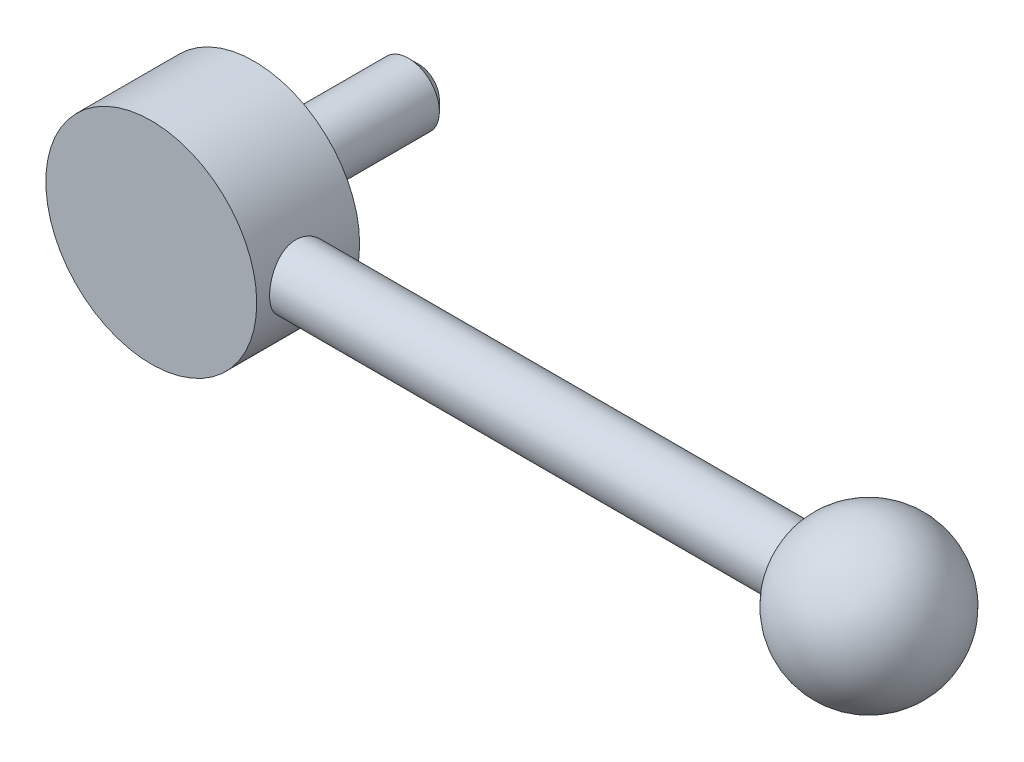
ISO-10303-21;
HEADER;
FILE_DESCRIPTION(('STEP AP214'),'2;1');
FILE_NAME('part.step','',(''),(''),'','','');
FILE_SCHEMA(('AUTOMOTIVE_DESIGN { 1 0 10303 214 1 1 1 1 }'));
ENDSEC;
DATA;
#1=APPLICATION_CONTEXT('core data for automotive mechanical design processes');
#2=APPLICATION_PROTOCOL_DEFINITION('international standard','automotive_design',2000,#1);
#3=PRODUCT_CONTEXT('',#1,'mechanical');
#4=PRODUCT('Part','Part','',(#3));
#5=PRODUCT_RELATED_PRODUCT_CATEGORY('part','',(#4));
#6=PRODUCT_DEFINITION_FORMATION('','',#4);
#7=PRODUCT_DEFINITION_CONTEXT('part definition',#1,'design');
#8=PRODUCT_DEFINITION('design','',#6,#7);
#9=PRODUCT_DEFINITION_SHAPE('','',#8);
#10=(LENGTH_UNIT() NAMED_UNIT(*) SI_UNIT(.MILLI.,.METRE.));
#11=(NAMED_UNIT(*) PLANE_ANGLE_UNIT() SI_UNIT($,.RADIAN.));
#12=(NAMED_UNIT(*) SI_UNIT($,.STERADIAN.) SOLID_ANGLE_UNIT());
#13=UNCERTAINTY_MEASURE_WITH_UNIT(LENGTH_MEASURE(1.E-05),#10,'distance_accuracy_value','');
#14=(GEOMETRIC_REPRESENTATION_CONTEXT(3) GLOBAL_UNCERTAINTY_ASSIGNED_CONTEXT((#13)) GLOBAL_UNIT_ASSIGNED_CONTEXT((#10,
#11,#12)) REPRESENTATION_CONTEXT('',''));
#15=CARTESIAN_POINT('',(0.,0.,0.));
#16=DIRECTION('',(0.,0.,1.));
#17=DIRECTION('',(1.,0.,0.));
#18=AXIS2_PLACEMENT_3D('',#15,#16,#17);
#19=CARTESIAN_POINT('',(0.,0.,40.));
#20=DIRECTION('',(0.,0.,1.));
#21=DIRECTION('',(1.,0.,0.));
#22=AXIS2_PLACEMENT_3D('',#19,#20,#21);
#23=CYLINDRICAL_SURFACE('',#22,9.5);
#24=CARTESIAN_POINT('',(0.,0.,2.));
#25=DIRECTION('',(0.,0.,1.));
#26=DIRECTION('',(1.,0.,0.));
#27=AXIS2_PLACEMENT_3D('',#24,#25,#26);
#28=CIRCLE('',#27,9.5);
#29=CARTESIAN_POINT('',(9.5,0.,2.));
#30=VERTEX_POINT('',#29);
#31=EDGE_CURVE('E37',#30,#30,#28,.T.);
#32=ORIENTED_EDGE('',*,*,#31,.F.);
#33=EDGE_LOOP('',(#32));
#34=FACE_BOUND('',#33,.T.);
#35=CARTESIAN_POINT('',(0.,0.,0.));
#36=DIRECTION('',(0.,0.,1.));
#37=DIRECTION('',(1.,0.,0.));
#38=AXIS2_PLACEMENT_3D('',#35,#36,#37);
#39=CIRCLE('',#38,9.5);
#40=CARTESIAN_POINT('',(9.5,0.,0.));
#41=VERTEX_POINT('',#40);
#42=EDGE_CURVE('E23',#41,#41,#39,.T.);
#43=ORIENTED_EDGE('',*,*,#42,.T.);
#44=EDGE_LOOP('',(#43));
#45=FACE_BOUND('',#44,.T.);
#46=ADVANCED_FACE('F12',(#34,#45),#23,.T.);
#47=CARTESIAN_POINT('',(6.,0.,0.));
#48=DIRECTION('',(0.,0.,1.));
#49=DIRECTION('',(1.,0.,0.));
#50=AXIS2_PLACEMENT_3D('',#47,#48,#49);
#51=PLANE('',#50);
#52=ORIENTED_EDGE('',*,*,#42,.F.);
#53=EDGE_LOOP('',(#52));
#54=FACE_BOUND('',#53,.T.);
#55=CARTESIAN_POINT('',(0.,0.,0.));
#56=DIRECTION('',(0.,0.,1.));
#57=DIRECTION('',(1.,0.,0.));
#58=AXIS2_PLACEMENT_3D('',#55,#56,#57);
#59=CIRCLE('',#58,6.);
#60=CARTESIAN_POINT('',(6.,0.,0.));
#61=VERTEX_POINT('',#60);
#62=EDGE_CURVE('E27',#61,#61,#59,.T.);
#63=ORIENTED_EDGE('',*,*,#62,.T.);
#64=EDGE_LOOP('',(#63));
#65=FACE_BOUND('',#64,.T.);
#66=ADVANCED_FACE('F63',(#54,#65),#51,.F.);
#67=CARTESIAN_POINT('',(0.,0.,40.));
#68=DIRECTION('',(0.,0.,1.));
#69=DIRECTION('',(1.,0.,0.));
#70=AXIS2_PLACEMENT_3D('',#67,#68,#69);
#71=CYLINDRICAL_SURFACE('',#70,6.);
#72=CARTESIAN_POINT('',(0.,0.,-28.));
#73=DIRECTION('',(0.,0.,-1.));
#74=DIRECTION('',(-1.,0.,0.));
#75=AXIS2_PLACEMENT_3D('',#72,#73,#74);
#76=CIRCLE('',#75,6.);
#77=CARTESIAN_POINT('',(-6.,0.,-28.));
#78=VERTEX_POINT('',#77);
#79=EDGE_CURVE('E19',#78,#78,#76,.F.);
#80=ORIENTED_EDGE('',*,*,#79,.T.);
#81=EDGE_LOOP('',(#80));
#82=FACE_BOUND('',#81,.T.);
#83=ORIENTED_EDGE('',*,*,#62,.F.);
#84=EDGE_LOOP('',(#83));
#85=FACE_BOUND('',#84,.T.);
#86=ADVANCED_FACE('F69',(#82,#85),#71,.T.);
#87=CARTESIAN_POINT('',(6.,0.,-30.));
#88=DIRECTION('',(0.,0.,-1.));
#89=DIRECTION('',(-1.,0.,0.));
#90=AXIS2_PLACEMENT_3D('',#87,#88,#89);
#91=PLANE('',#90);
#92=CARTESIAN_POINT('',(0.,0.,-30.));
#93=DIRECTION('',(0.,0.,-1.));
#94=DIRECTION('',(-1.,0.,0.));
#95=AXIS2_PLACEMENT_3D('',#92,#93,#94);
#96=CIRCLE('',#95,4.);
#97=CARTESIAN_POINT('',(-4.,0.,-30.));
#98=VERTEX_POINT('',#97);
#99=EDGE_CURVE('E8',#98,#98,#96,.T.);
#100=ORIENTED_EDGE('',*,*,#99,.T.);
#101=EDGE_LOOP('',(#100));
#102=FACE_BOUND('',#101,.T.);
#103=ADVANCED_FACE('F77',(#102),#91,.T.);
#104=CARTESIAN_POINT('',(20.5,0.,22.));
#105=DIRECTION('',(0.,0.,-1.));
#106=DIRECTION('',(-1.,0.,0.));
#107=AXIS2_PLACEMENT_3D('',#104,#105,#106);
#108=PLANE('',#107);
#109=CARTESIAN_POINT('',(0.,0.,22.));
#110=DIRECTION('',(0.,0.,1.));
#111=DIRECTION('',(1.,0.,0.));
#112=AXIS2_PLACEMENT_3D('',#109,#110,#111);
#113=CIRCLE('',#112,20.5);
#114=CARTESIAN_POINT('',(20.5,0.,22.));
#115=VERTEX_POINT('',#114);
#116=EDGE_CURVE('E86',#115,#115,#113,.T.);
#117=ORIENTED_EDGE('',*,*,#116,.T.);
#118=EDGE_LOOP('',(#117));
#119=FACE_BOUND('',#118,.T.);
#120=ADVANCED_FACE('F58',(#119),#108,.F.);
#121=CARTESIAN_POINT('',(0.,0.,40.));
#122=DIRECTION('',(0.,0.,1.));
#123=DIRECTION('',(1.,0.,0.));
#124=AXIS2_PLACEMENT_3D('',#121,#122,#123);
#125=CYLINDRICAL_SURFACE('',#124,20.5);
#126=CARTESIAN_POINT('',(20.5,0.,7.5));
#127=CARTESIAN_POINT('',(20.4999997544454,-0.164768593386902,7.50000038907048));
#128=CARTESIAN_POINT('',(20.4980087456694,-0.329544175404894,7.50679278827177));
#129=CARTESIAN_POINT('',(20.4900990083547,-0.65788822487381,7.5339021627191));
#130=CARTESIAN_POINT('',(20.4841800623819,-0.821456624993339,7.55421988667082));
#131=CARTESIAN_POINT('',(20.4685766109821,-1.1462122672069,7.60820100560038));
#132=CARTESIAN_POINT('',(20.4588916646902,-1.30739922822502,7.64186596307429));
#133=CARTESIAN_POINT('',(20.4360164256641,-1.62628314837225,7.72226244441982));
#134=CARTESIAN_POINT('',(20.4228249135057,-1.7839788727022,7.76899851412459));
#135=CARTESIAN_POINT('',(20.3933182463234,-2.09448185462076,7.87505403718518));
#136=CARTESIAN_POINT('',(20.3770082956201,-2.24729676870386,7.93435254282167));
#137=CARTESIAN_POINT('',(20.3416823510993,-2.54730770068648,8.06511256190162));
#138=CARTESIAN_POINT('',(20.3226662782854,-2.69450355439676,8.13657443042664));
#139=CARTESIAN_POINT('',(20.2824208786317,-2.98237032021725,8.2911456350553));
#140=CARTESIAN_POINT('',(20.2611910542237,-3.123039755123,8.37425759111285));
#141=CARTESIAN_POINT('',(20.2170775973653,-3.39691169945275,8.55150630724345));
#142=CARTESIAN_POINT('',(20.1941944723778,-3.53011647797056,8.6456396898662));
#143=CARTESIAN_POINT('',(20.146767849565,-3.79154794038,8.84682399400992));
#144=CARTESIAN_POINT('',(20.1221971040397,-3.91956600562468,8.95413966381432));
#145=CARTESIAN_POINT('',(20.0725990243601,-4.1661228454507,9.17897611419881));
#146=CARTESIAN_POINT('',(20.0475718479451,-4.2846648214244,9.29649342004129));
#147=CARTESIAN_POINT('',(19.9977175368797,-4.5116297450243,9.54108035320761));
#148=CARTESIAN_POINT('',(19.9728905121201,-4.62004743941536,9.66815487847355));
#149=CARTESIAN_POINT('',(19.9241410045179,-4.82595045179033,9.93095842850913));
#150=CARTESIAN_POINT('',(19.9002181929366,-4.92343976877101,10.0666842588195));
#151=CARTESIAN_POINT('',(19.8534354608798,-5.10885934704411,10.3490171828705));
#152=CARTESIAN_POINT('',(19.8306098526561,-5.19653638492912,10.4957964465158));
#153=CARTESIAN_POINT('',(19.7872868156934,-5.35913808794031,10.7965125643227));
#154=CARTESIAN_POINT('',(19.766788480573,-5.43406772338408,10.9504465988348));
#155=CARTESIAN_POINT('',(19.7287391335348,-5.57062666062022,11.2645036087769));
#156=CARTESIAN_POINT('',(19.7111887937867,-5.63225293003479,11.4246279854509));
#157=CARTESIAN_POINT('',(19.6796082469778,-5.74162541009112,11.7498143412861));
#158=CARTESIAN_POINT('',(19.6655765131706,-5.78937764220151,11.9148741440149));
#159=CARTESIAN_POINT('',(19.6418018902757,-5.86952471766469,12.2443484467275));
#160=CARTESIAN_POINT('',(19.6319555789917,-5.90229162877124,12.4086649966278));
#161=CARTESIAN_POINT('',(19.6163432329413,-5.95397424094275,12.7395899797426));
#162=CARTESIAN_POINT('',(19.6105755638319,-5.97289549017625,12.9061974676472));
#163=CARTESIAN_POINT('',(19.603301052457,-5.99672775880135,13.2405034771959));
#164=CARTESIAN_POINT('',(19.6017941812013,-6.00163887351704,13.4082019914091));
#165=CARTESIAN_POINT('',(19.6030905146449,-5.99740342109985,13.7434027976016));
#166=CARTESIAN_POINT('',(19.6058936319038,-5.98825713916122,13.9109050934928));
#167=CARTESIAN_POINT('',(19.6155486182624,-5.95655212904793,14.238688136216));
#168=CARTESIAN_POINT('',(19.6222578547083,-5.9344657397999,14.3990190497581));
#169=CARTESIAN_POINT('',(19.6394095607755,-5.87745500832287,14.7172343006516));
#170=CARTESIAN_POINT('',(19.649853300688,-5.84252629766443,14.8751177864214));
#171=CARTESIAN_POINT('',(19.6741615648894,-5.7601395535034,15.187257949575));
#172=CARTESIAN_POINT('',(19.688025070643,-5.71268525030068,15.3415156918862));
#173=CARTESIAN_POINT('',(19.7187796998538,-5.60560692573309,15.6454959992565));
#174=CARTESIAN_POINT('',(19.7356719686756,-5.5459782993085,15.7952168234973));
#175=CARTESIAN_POINT('',(19.7722410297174,-5.41416819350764,16.0910079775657));
#176=CARTESIAN_POINT('',(19.7919506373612,-5.34183608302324,16.2370072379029));
#177=CARTESIAN_POINT('',(19.8334359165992,-5.18568691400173,16.5224423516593));
#178=CARTESIAN_POINT('',(19.8552123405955,-5.10186566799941,16.6618757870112));
#179=CARTESIAN_POINT('',(19.9227548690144,-4.8340177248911,17.0689782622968));
#180=CARTESIAN_POINT('',(19.9707648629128,-4.63350124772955,17.3256854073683));
#181=CARTESIAN_POINT('',(20.0696162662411,-4.18511260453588,17.8126329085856));
#182=CARTESIAN_POINT('',(20.1204944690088,-3.93567819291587,18.0414205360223));
#183=CARTESIAN_POINT('',(20.2176813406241,-3.40132203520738,18.4542852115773));
#184=CARTESIAN_POINT('',(20.2639897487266,-3.11639826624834,18.63835970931));
#185=CARTESIAN_POINT('',(20.3472018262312,-2.51664006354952,18.9573414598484));
#186=CARTESIAN_POINT('',(20.3840462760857,-2.2016334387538,19.0919412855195));
#187=CARTESIAN_POINT('',(20.4437541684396,-1.55212614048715,19.3058343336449));
#188=CARTESIAN_POINT('',(20.4666213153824,-1.21763065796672,19.3851422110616));
#189=CARTESIAN_POINT('',(20.4952175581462,-0.550953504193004,19.4838192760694));
#190=CARTESIAN_POINT('',(20.5015074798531,-0.219085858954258,19.5051506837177));
#191=CARTESIAN_POINT('',(20.4978783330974,0.44350281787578,19.4927506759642));
#192=CARTESIAN_POINT('',(20.4879613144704,0.774223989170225,19.4590262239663));
#193=CARTESIAN_POINT('',(20.4533992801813,1.41781519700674,19.3390673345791));
#194=CARTESIAN_POINT('',(20.4290727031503,1.73091547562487,19.253967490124));
#195=CARTESIAN_POINT('',(20.3684901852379,2.33834273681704,19.0350155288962));
#196=CARTESIAN_POINT('',(20.3322328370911,2.63266749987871,18.901157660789));
#197=CARTESIAN_POINT('',(20.2505580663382,3.201467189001,18.585163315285));
#198=CARTESIAN_POINT('',(20.2049537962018,3.47535043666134,18.4020133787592));
#199=CARTESIAN_POINT('',(20.1098009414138,3.98926947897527,17.9937010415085));
#200=CARTESIAN_POINT('',(20.0602514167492,4.22929716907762,17.7685286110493));
#201=CARTESIAN_POINT('',(19.9860369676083,4.56311282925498,17.3996018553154));
#202=CARTESIAN_POINT('',(19.9608943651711,4.67160496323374,17.2689475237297));
#203=CARTESIAN_POINT('',(19.9116554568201,4.87720494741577,16.9988051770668));
#204=CARTESIAN_POINT('',(19.8875587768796,4.97431688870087,16.8593203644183));
#205=CARTESIAN_POINT('',(19.8411019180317,5.15650338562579,16.5723575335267));
#206=CARTESIAN_POINT('',(19.8187424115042,5.24157329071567,16.4248764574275));
#207=CARTESIAN_POINT('',(19.7764458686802,5.39896546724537,16.1230001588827));
#208=CARTESIAN_POINT('',(19.7565078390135,5.47129297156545,15.9686078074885));
#209=CARTESIAN_POINT('',(19.7197444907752,5.60234699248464,15.6546484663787));
#210=CARTESIAN_POINT('',(19.7029051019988,5.6611353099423,15.49510893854));
#211=CARTESIAN_POINT('',(19.6727610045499,5.76501533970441,15.1713718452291));
#212=CARTESIAN_POINT('',(19.6594548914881,5.81011249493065,15.0071761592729));
#213=CARTESIAN_POINT('',(19.6367999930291,5.88622676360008,14.675294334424));
#214=CARTESIAN_POINT('',(19.6274509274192,5.91724487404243,14.5076084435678));
#215=CARTESIAN_POINT('',(19.6130187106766,5.96490739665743,14.1700260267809));
#216=CARTESIAN_POINT('',(19.6079354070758,5.98155232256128,14.0001295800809));
#217=CARTESIAN_POINT('',(19.6023186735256,5.9999323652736,13.6662567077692));
#218=CARTESIAN_POINT('',(19.6016119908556,6.00223524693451,13.5023141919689));
#219=CARTESIAN_POINT('',(19.6043094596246,5.99341910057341,13.1747666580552));
#220=CARTESIAN_POINT('',(19.6077150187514,5.98229547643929,13.0111617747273));
#221=CARTESIAN_POINT('',(19.6185313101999,5.94672790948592,12.6856110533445));
#222=CARTESIAN_POINT('',(19.6259403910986,5.92228945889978,12.5236645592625));
#223=CARTESIAN_POINT('',(19.6445384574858,5.86030325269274,12.2024601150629));
#224=CARTESIAN_POINT('',(19.6557288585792,5.82275058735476,12.0432031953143));
#225=CARTESIAN_POINT('',(19.6814005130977,5.73537439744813,11.7303823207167));
#226=CARTESIAN_POINT('',(19.6958418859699,5.68569901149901,11.5767736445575));
#227=CARTESIAN_POINT('',(19.7276768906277,5.57423736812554,11.2742707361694));
#228=CARTESIAN_POINT('',(19.7450715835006,5.51244675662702,11.125378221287));
#229=CARTESIAN_POINT('',(19.782319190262,5.37724463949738,10.8333301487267));
#230=CARTESIAN_POINT('',(19.802171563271,5.30383568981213,10.6901733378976));
#231=CARTESIAN_POINT('',(19.8438063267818,5.14587421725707,10.4103722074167));
#232=CARTESIAN_POINT('',(19.8655894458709,5.061317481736,10.2737303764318));
#233=CARTESIAN_POINT('',(19.9112797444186,4.87853600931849,10.0032239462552));
#234=CARTESIAN_POINT('',(19.9352342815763,4.77994030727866,9.86961789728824));
#235=CARTESIAN_POINT('',(19.9839347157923,4.57206196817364,9.61107007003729));
#236=CARTESIAN_POINT('',(20.0086809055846,4.46277534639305,9.48613155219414));
#237=CARTESIAN_POINT('',(20.0582834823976,4.23425660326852,9.24575891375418));
#238=CARTESIAN_POINT('',(20.0831398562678,4.11502564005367,9.13032368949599));
#239=CARTESIAN_POINT('',(20.1323098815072,3.86730499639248,8.90963180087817));
#240=CARTESIAN_POINT('',(20.1566233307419,3.7388119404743,8.80437888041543));
#241=CARTESIAN_POINT('',(20.2046974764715,3.46977987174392,8.6020699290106));
#242=CARTESIAN_POINT('',(20.2284250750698,3.32900807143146,8.50531528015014));
#243=CARTESIAN_POINT('',(20.2739466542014,3.03949915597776,8.32403500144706));
#244=CARTESIAN_POINT('',(20.2957406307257,2.8907620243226,8.23950939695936));
#245=CARTESIAN_POINT('',(20.3367679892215,2.58639447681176,8.0833769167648));
#246=CARTESIAN_POINT('',(20.356002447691,2.43076699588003,8.01176460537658));
#247=CARTESIAN_POINT('',(20.3913677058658,2.11366097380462,7.88201306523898));
#248=CARTESIAN_POINT('',(20.4074988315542,1.95218304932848,7.82387242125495));
#249=CARTESIAN_POINT('',(20.4344672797,1.64423058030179,7.72771145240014));
#250=CARTESIAN_POINT('',(20.4457076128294,1.49828162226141,7.68811373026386));
#251=CARTESIAN_POINT('',(20.4651675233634,1.2036242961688,7.62002138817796));
#252=CARTESIAN_POINT('',(20.4733873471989,1.0549161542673,7.59152586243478));
#253=CARTESIAN_POINT('',(20.4866168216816,0.755624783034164,7.54584620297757));
#254=CARTESIAN_POINT('',(20.491626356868,0.605041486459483,7.52866247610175));
#255=CARTESIAN_POINT('',(20.49831762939,0.302973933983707,7.50574067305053));
#256=CARTESIAN_POINT('',(20.5000002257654,0.151489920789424,7.49999964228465));
#257=CARTESIAN_POINT('',(20.5,0.,7.5));
#258=B_SPLINE_CURVE_WITH_KNOTS('',3,(#126,#127,#128,#129,#130,#131,#132,#133,#134,#135,#136,
#137,#138,#139,#140,#141,#142,#143,#144,#145,#146,#147,#148,#149,#150,#151,#152,#153,#154,#155,
#156,#157,#158,#159,#160,#161,#162,#163,#164,#165,#166,#167,#168,#169,#170,#171,#172,#173,#174,
#175,#176,#177,#178,#179,#180,#181,#182,#183,#184,#185,#186,#187,#188,#189,#190,#191,#192,#193,
#194,#195,#196,#197,#198,#199,#200,#201,#202,#203,#204,#205,#206,#207,#208,#209,#210,#211,#212,
#213,#214,#215,#216,#217,#218,#219,#220,#221,#222,#223,#224,#225,#226,#227,#228,#229,#230,#231,
#232,#233,#234,#235,#236,#237,#238,#239,#240,#241,#242,#243,#244,#245,#246,#247,#248,#249,#250,
#251,#252,#253,#254,#255,#256,#257),.UNSPECIFIED.,.T.,.F.,(4,2,2,2,2,2,2,2,2,2,2,2,2,2,2,2,2,2,
2,2,2,2,2,2,2,2,2,2,2,2,2,2,2,2,2,2,2,2,2,2,2,2,2,2,2,2,2,2,2,2,2,2,2,2,2,2,2,2,2,2,2,2,2,2,2,
4),(0.,0.494166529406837,0.988360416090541,1.48261217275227,1.97703603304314,2.47064184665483,
2.96426207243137,3.45799348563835,3.95157399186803,4.45753270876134,4.96331976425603,
5.46936781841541,5.97523008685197,6.49206535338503,7.00869863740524,7.52544955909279,
8.04197586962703,8.54486934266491,9.04756118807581,9.55024961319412,10.0529278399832,
10.5383093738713,11.0238561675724,11.5092585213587,11.9948448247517,12.4866344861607,
12.9786038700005,13.9617709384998,14.9839152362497,16.006117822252,17.0345689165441,
18.062747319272,19.0556662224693,20.0484595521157,21.0200911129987,21.9918373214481,
22.9853318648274,23.97906383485,24.4935931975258,25.0079370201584,25.5224789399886,
26.0368090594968,26.5487427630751,27.0604726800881,27.5721663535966,28.0838417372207,
28.5751252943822,29.066577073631,29.5578262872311,30.0492596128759,30.5349645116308,
31.0208442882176,31.5066173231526,31.9925744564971,32.4953010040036,32.9982156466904,
33.5010718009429,34.0041121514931,34.5208552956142,35.0375995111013,35.5541256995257,
36.0705976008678,36.525077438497,36.9795201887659,37.4339792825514,37.8883210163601),.UNSPECIFIED.);
#259=CARTESIAN_POINT('',(20.5,0.,7.5));
#260=VERTEX_POINT('',#259);
#261=EDGE_CURVE('E30',#260,#260,#258,.T.);
#262=ORIENTED_EDGE('',*,*,#261,.T.);
#263=EDGE_LOOP('',(#262));
#264=FACE_BOUND('',#263,.T.);
#265=ORIENTED_EDGE('',*,*,#116,.F.);
#266=EDGE_LOOP('',(#265));
#267=FACE_BOUND('',#266,.T.);
#268=CARTESIAN_POINT('',(0.,0.,2.));
#269=DIRECTION('',(0.,0.,1.));
#270=DIRECTION('',(1.,0.,0.));
#271=AXIS2_PLACEMENT_3D('',#268,#269,#270);
#272=CIRCLE('',#271,20.5);
#273=CARTESIAN_POINT('',(20.5,0.,2.));
#274=VERTEX_POINT('',#273);
#275=EDGE_CURVE('E88',#274,#274,#272,.T.);
#276=ORIENTED_EDGE('',*,*,#275,.T.);
#277=EDGE_LOOP('',(#276));
#278=FACE_BOUND('',#277,.T.);
#279=ADVANCED_FACE('F40',(#264,#267,#278),#125,.T.);
#280=CARTESIAN_POINT('',(9.5,0.,2.));
#281=DIRECTION('',(0.,0.,1.));
#282=DIRECTION('',(1.,0.,0.));
#283=AXIS2_PLACEMENT_3D('',#280,#281,#282);
#284=PLANE('',#283);
#285=ORIENTED_EDGE('',*,*,#275,.F.);
#286=EDGE_LOOP('',(#285));
#287=FACE_BOUND('',#286,.T.);
#288=ORIENTED_EDGE('',*,*,#31,.T.);
#289=EDGE_LOOP('',(#288));
#290=FACE_BOUND('',#289,.T.);
#291=ADVANCED_FACE('F49',(#287,#290),#284,.F.);
#292=CARTESIAN_POINT('',(-30.,0.,13.5));
#293=DIRECTION('',(-1.,0.,0.));
#294=DIRECTION('',(0.,0.,1.));
#295=AXIS2_PLACEMENT_3D('',#292,#293,#294);
#296=CYLINDRICAL_SURFACE('',#295,6.);
#297=CARTESIAN_POINT('',(117.252272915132,0.,13.5));
#298=DIRECTION('',(-1.,0.,0.));
#299=DIRECTION('',(0.,0.,1.));
#300=AXIS2_PLACEMENT_3D('',#297,#298,#299);
#301=CIRCLE('',#300,6.);
#302=CARTESIAN_POINT('',(117.252272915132,0.,19.5));
#303=VERTEX_POINT('',#302);
#304=EDGE_CURVE('E38',#303,#303,#301,.T.);
#305=ORIENTED_EDGE('',*,*,#304,.T.);
#306=EDGE_LOOP('',(#305));
#307=FACE_BOUND('',#306,.T.);
#308=ORIENTED_EDGE('',*,*,#261,.F.);
#309=EDGE_LOOP('',(#308));
#310=FACE_BOUND('',#309,.T.);
#311=ADVANCED_FACE('F44',(#307,#310),#296,.T.);
#312=CARTESIAN_POINT('',(131.,0.,13.5));
#313=DIRECTION('',(0.,0.,1.));
#314=DIRECTION('',(1.,0.,0.));
#315=AXIS2_PLACEMENT_3D('',#312,#313,#314);
#316=SPHERICAL_SURFACE('',#315,15.);
#317=CARTESIAN_POINT('',(131.,0.,13.5));
#318=DIRECTION('',(-1.,0.,0.));
#319=DIRECTION('',(0.,0.,1.));
#320=AXIS2_PLACEMENT_3D('',#317,#318,#319);
#321=SPHERICAL_SURFACE('',#320,15.);
#322=ORIENTED_EDGE('',*,*,#304,.F.);
#323=EDGE_LOOP('',(#322));
#324=FACE_BOUND('',#323,.T.);
#325=ADVANCED_FACE('F48',(#324),#321,.T.);
#326=CARTESIAN_POINT('',(0.,0.,-28.));
#327=DIRECTION('',(0.,0.,1.));
#328=DIRECTION('',(1.,0.,0.));
#329=AXIS2_PLACEMENT_3D('',#326,#327,#328);
#330=CONICAL_SURFACE('',#329,6.,0.785398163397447);
#331=ORIENTED_EDGE('',*,*,#99,.F.);
#332=EDGE_LOOP('',(#331));
#333=FACE_BOUND('',#332,.T.);
#334=ORIENTED_EDGE('',*,*,#79,.F.);
#335=EDGE_LOOP('',(#334));
#336=FACE_BOUND('',#335,.T.);
#337=ADVANCED_FACE('F14',(#333,#336),#330,.T.);
#338=CLOSED_SHELL('',(#46,#66,#86,#103,#120,#279,#291,#311,#325,#337));
#339=MANIFOLD_SOLID_BREP('B1',#338);
#340=ADVANCED_BREP_SHAPE_REPRESENTATION('',(#18,#339),#14);
#341=SHAPE_DEFINITION_REPRESENTATION(#9,#340);
ENDSEC;
END-ISO-10303-21;
